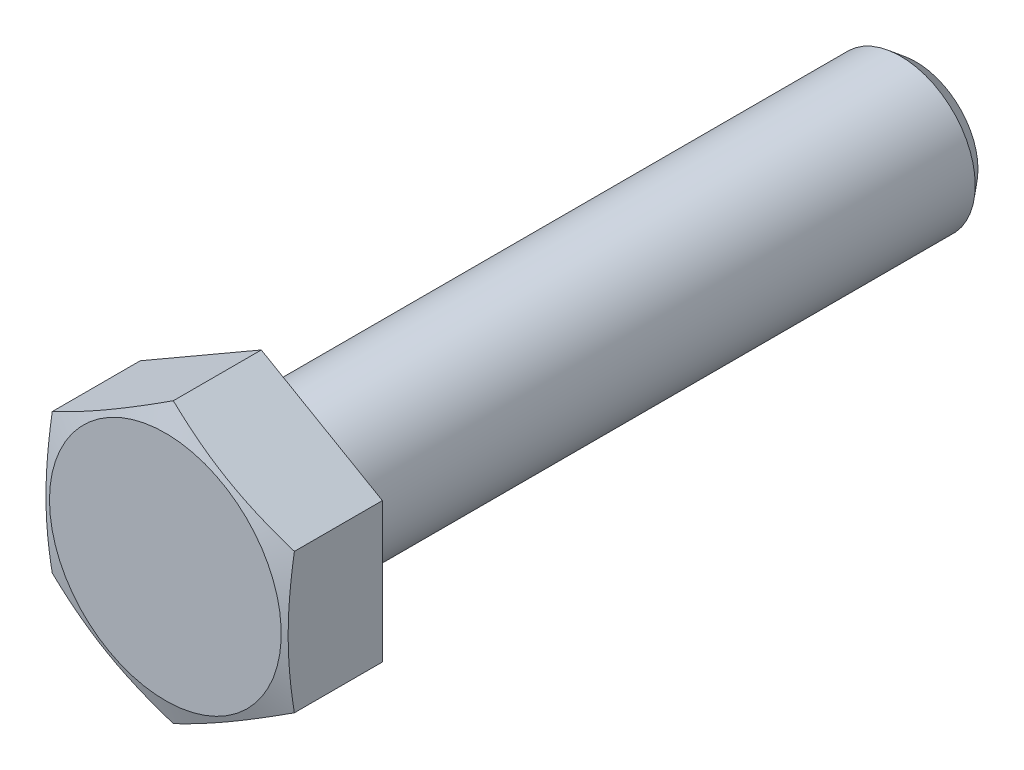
ISO-10303-21;
HEADER;
FILE_DESCRIPTION(('STEP AP214'),'2;1');
FILE_NAME('part.step','',(''),(''),'','','');
FILE_SCHEMA(('AUTOMOTIVE_DESIGN { 1 0 10303 214 1 1 1 1 }'));
ENDSEC;
DATA;
#1=APPLICATION_CONTEXT('core data for automotive mechanical design processes');
#2=APPLICATION_PROTOCOL_DEFINITION('international standard','automotive_design',2000,#1);
#3=PRODUCT_CONTEXT('',#1,'mechanical');
#4=PRODUCT('Part','Part','',(#3));
#5=PRODUCT_RELATED_PRODUCT_CATEGORY('part','',(#4));
#6=PRODUCT_DEFINITION_FORMATION('','',#4);
#7=PRODUCT_DEFINITION_CONTEXT('part definition',#1,'design');
#8=PRODUCT_DEFINITION('design','',#6,#7);
#9=PRODUCT_DEFINITION_SHAPE('','',#8);
#10=(LENGTH_UNIT() NAMED_UNIT(*) SI_UNIT(.MILLI.,.METRE.));
#11=(NAMED_UNIT(*) PLANE_ANGLE_UNIT() SI_UNIT($,.RADIAN.));
#12=(NAMED_UNIT(*) SI_UNIT($,.STERADIAN.) SOLID_ANGLE_UNIT());
#13=UNCERTAINTY_MEASURE_WITH_UNIT(LENGTH_MEASURE(1.E-05),#10,'distance_accuracy_value','');
#14=(GEOMETRIC_REPRESENTATION_CONTEXT(3) GLOBAL_UNCERTAINTY_ASSIGNED_CONTEXT((#13)) GLOBAL_UNIT_ASSIGNED_CONTEXT((#10,
#11,#12)) REPRESENTATION_CONTEXT('',''));
#15=CARTESIAN_POINT('',(0.,0.,0.));
#16=DIRECTION('',(0.,0.,1.));
#17=DIRECTION('',(1.,0.,0.));
#18=AXIS2_PLACEMENT_3D('',#15,#16,#17);
#19=CARTESIAN_POINT('',(0.,0.,0.15));
#20=DIRECTION('',(0.,0.,1.));
#21=DIRECTION('',(1.,0.,0.));
#22=AXIS2_PLACEMENT_3D('',#19,#20,#21);
#23=TOROIDAL_SURFACE('',#22,5.65,0.15);
#24=CARTESIAN_POINT('',(0.,0.,0.15));
#25=DIRECTION('',(0.,0.,1.));
#26=DIRECTION('',(1.,0.,0.));
#27=AXIS2_PLACEMENT_3D('',#24,#25,#26);
#28=CIRCLE('',#27,5.8);
#29=CARTESIAN_POINT('',(5.8,0.,0.15));
#30=VERTEX_POINT('',#29);
#31=EDGE_CURVE('E11',#30,#30,#28,.T.);
#32=ORIENTED_EDGE('',*,*,#31,.F.);
#33=EDGE_LOOP('',(#32));
#34=FACE_BOUND('',#33,.T.);
#35=CARTESIAN_POINT('',(0.,0.,0.));
#36=DIRECTION('',(0.,0.,1.));
#37=DIRECTION('',(1.,0.,0.));
#38=AXIS2_PLACEMENT_3D('',#35,#36,#37);
#39=CIRCLE('',#38,5.65);
#40=CARTESIAN_POINT('',(5.65,0.,0.));
#41=VERTEX_POINT('',#40);
#42=EDGE_CURVE('E39',#41,#41,#39,.T.);
#43=ORIENTED_EDGE('',*,*,#42,.T.);
#44=EDGE_LOOP('',(#43));
#45=FACE_BOUND('',#44,.T.);
#46=ADVANCED_FACE('F32',(#34,#45),#23,.T.);
#47=CARTESIAN_POINT('',(0.,5.65,0.));
#48=DIRECTION('',(0.,0.,-1.));
#49=DIRECTION('',(-1.,0.,0.));
#50=AXIS2_PLACEMENT_3D('',#47,#48,#49);
#51=PLANE('',#50);
#52=CARTESIAN_POINT('',(0.,0.,0.));
#53=DIRECTION('',(0.,0.,1.));
#54=DIRECTION('',(1.,0.,0.));
#55=AXIS2_PLACEMENT_3D('',#52,#53,#54);
#56=CIRCLE('',#55,4.4);
#57=CARTESIAN_POINT('',(4.4,0.,0.));
#58=VERTEX_POINT('',#57);
#59=EDGE_CURVE('E124',#58,#58,#56,.T.);
#60=ORIENTED_EDGE('',*,*,#59,.T.);
#61=EDGE_LOOP('',(#60));
#62=FACE_BOUND('',#61,.T.);
#63=ORIENTED_EDGE('',*,*,#42,.F.);
#64=EDGE_LOOP('',(#63));
#65=FACE_BOUND('',#64,.T.);
#66=ADVANCED_FACE('F130',(#62,#65),#51,.T.);
#67=CARTESIAN_POINT('',(0.,0.,-0.4));
#68=DIRECTION('',(0.,0.,1.));
#69=DIRECTION('',(1.,0.,0.));
#70=AXIS2_PLACEMENT_3D('',#67,#68,#69);
#71=TOROIDAL_SURFACE('',#70,4.4,0.4);
#72=CARTESIAN_POINT('',(0.,0.,-0.4));
#73=DIRECTION('',(0.,0.,1.));
#74=DIRECTION('',(1.,0.,0.));
#75=AXIS2_PLACEMENT_3D('',#72,#73,#74);
#76=CIRCLE('',#75,4.);
#77=CARTESIAN_POINT('',(4.,0.,-0.4));
#78=VERTEX_POINT('',#77);
#79=EDGE_CURVE('E121',#78,#78,#76,.T.);
#80=ORIENTED_EDGE('',*,*,#79,.T.);
#81=EDGE_LOOP('',(#80));
#82=FACE_BOUND('',#81,.T.);
#83=ORIENTED_EDGE('',*,*,#59,.F.);
#84=EDGE_LOOP('',(#83));
#85=FACE_BOUND('',#84,.T.);
#86=ADVANCED_FACE('F132',(#82,#85),#71,.F.);
#87=CARTESIAN_POINT('',(-6.5,-3.752775,0.15));
#88=DIRECTION('',(0.,0.,-1.));
#89=DIRECTION('',(-1.,0.,0.));
#90=AXIS2_PLACEMENT_3D('',#87,#88,#89);
#91=PLANE('',#90);
#92=DIRECTION('',(0.,-1.,0.));
#93=VECTOR('',#92,1.);
#94=CARTESIAN_POINT('',(-6.5,3.752775,0.15));
#95=LINE('',#94,#93);
#96=CARTESIAN_POINT('',(-6.5,3.752775,0.15));
#97=VERTEX_POINT('',#96);
#98=CARTESIAN_POINT('',(-6.5,-3.752775,0.15));
#99=VERTEX_POINT('',#98);
#100=EDGE_CURVE('E98',#97,#99,#95,.T.);
#101=ORIENTED_EDGE('',*,*,#100,.F.);
#102=DIRECTION('',(0.866025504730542,0.499999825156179,0.));
#103=VECTOR('',#102,1.);
#104=CARTESIAN_POINT('',(-6.5,3.752775,0.15));
#105=LINE('',#104,#103);
#106=CARTESIAN_POINT('',(0.,7.50555,0.15));
#107=VERTEX_POINT('',#106);
#108=EDGE_CURVE('E103',#97,#107,#105,.T.);
#109=ORIENTED_EDGE('',*,*,#108,.T.);
#110=DIRECTION('',(0.866025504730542,-0.499999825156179,0.));
#111=VECTOR('',#110,1.);
#112=CARTESIAN_POINT('',(0.,7.50555,0.15));
#113=LINE('',#112,#111);
#114=CARTESIAN_POINT('',(6.5,3.752775,0.15));
#115=VERTEX_POINT('',#114);
#116=EDGE_CURVE('E109',#107,#115,#113,.T.);
#117=ORIENTED_EDGE('',*,*,#116,.T.);
#118=DIRECTION('',(0.,-1.,0.));
#119=VECTOR('',#118,1.);
#120=CARTESIAN_POINT('',(6.5,3.752775,0.15));
#121=LINE('',#120,#119);
#122=CARTESIAN_POINT('',(6.5,-3.752775,0.15));
#123=VERTEX_POINT('',#122);
#124=EDGE_CURVE('E245',#115,#123,#121,.T.);
#125=ORIENTED_EDGE('',*,*,#124,.T.);
#126=DIRECTION('',(-0.866025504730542,-0.499999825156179,0.));
#127=VECTOR('',#126,1.);
#128=CARTESIAN_POINT('',(6.5,-3.752775,0.15));
#129=LINE('',#128,#127);
#130=CARTESIAN_POINT('',(0.,-7.50555,0.15));
#131=VERTEX_POINT('',#130);
#132=EDGE_CURVE('E231',#123,#131,#129,.T.);
#133=ORIENTED_EDGE('',*,*,#132,.T.);
#134=DIRECTION('',(-0.866025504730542,0.499999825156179,0.));
#135=VECTOR('',#134,1.);
#136=CARTESIAN_POINT('',(0.,-7.50555,0.15));
#137=LINE('',#136,#135);
#138=EDGE_CURVE('E229',#131,#99,#137,.T.);
#139=ORIENTED_EDGE('',*,*,#138,.T.);
#140=EDGE_LOOP('',(#101,#109,#117,#125,#133,#139));
#141=FACE_BOUND('',#140,.T.);
#142=ORIENTED_EDGE('',*,*,#31,.T.);
#143=EDGE_LOOP('',(#142));
#144=FACE_BOUND('',#143,.T.);
#145=ADVANCED_FACE('F138',(#141,#144),#91,.T.);
#146=CARTESIAN_POINT('',(-6.5,3.752775,0.15));
#147=DIRECTION('',(-1.,0.,0.));
#148=DIRECTION('',(0.,0.,1.));
#149=AXIS2_PLACEMENT_3D('',#146,#147,#148);
#150=PLANE('',#149);
#151=CARTESIAN_POINT('',(-6.5,-9.92768465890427,3.42219076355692));
#152=CARTESIAN_POINT('',(-6.5,-9.63320200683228,3.50410507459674));
#153=CARTESIAN_POINT('',(-6.5,-9.33844353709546,3.58504584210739));
#154=CARTESIAN_POINT('',(-6.5,-8.74823643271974,3.74444577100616));
#155=CARTESIAN_POINT('',(-6.5,-8.45278775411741,3.82290476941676));
#156=CARTESIAN_POINT('',(-6.5,-7.86064924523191,3.97691306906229));
#157=CARTESIAN_POINT('',(-6.5,-7.56395820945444,4.05245775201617));
#158=CARTESIAN_POINT('',(-6.5,-6.96964246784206,4.19977756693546));
#159=CARTESIAN_POINT('',(-6.5,-6.67201777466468,4.27155274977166));
#160=CARTESIAN_POINT('',(-6.5,-6.07920080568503,4.40958972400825));
#161=CARTESIAN_POINT('',(-6.5,-5.78402145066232,4.47590673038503));
#162=CARTESIAN_POINT('',(-6.5,-5.19244039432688,4.60283348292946));
#163=CARTESIAN_POINT('',(-6.5,-4.89603873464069,4.66344342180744));
#164=CARTESIAN_POINT('',(-6.5,-4.30192301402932,4.77756540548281));
#165=CARTESIAN_POINT('',(-6.5,-4.00420923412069,4.83107890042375));
#166=CARTESIAN_POINT('',(-6.5,-3.4073313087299,4.92939310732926));
#167=CARTESIAN_POINT('',(-6.5,-3.10816717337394,4.9741938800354));
#168=CARTESIAN_POINT('',(-6.5,-2.51584786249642,5.05231938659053));
#169=CARTESIAN_POINT('',(-6.5,-2.22272695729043,5.08590043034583));
#170=CARTESIAN_POINT('',(-6.5,-1.6353790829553,5.14147194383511));
#171=CARTESIAN_POINT('',(-6.5,-1.34115215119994,5.16346280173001));
#172=CARTESIAN_POINT('',(-6.5,-0.752211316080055,5.19459534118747));
#173=CARTESIAN_POINT('',(-6.5,-0.457497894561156,5.20374596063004));
#174=CARTESIAN_POINT('',(-6.5,0.132041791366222,5.20865235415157));
#175=CARTESIAN_POINT('',(-6.5,0.426868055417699,5.20440817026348));
#176=CARTESIAN_POINT('',(-6.5,1.01755930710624,5.18273935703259));
#177=CARTESIAN_POINT('',(-6.5,1.31342173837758,5.16524639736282));
#178=CARTESIAN_POINT('',(-6.5,1.90416213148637,5.11804868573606));
#179=CARTESIAN_POINT('',(-6.5,2.19904006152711,5.08834354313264));
#180=CARTESIAN_POINT('',(-6.5,2.78778899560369,5.01822295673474));
#181=CARTESIAN_POINT('',(-6.5,3.08165875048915,4.97779718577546));
#182=CARTESIAN_POINT('',(-6.5,3.66800309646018,4.88794282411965));
#183=CARTESIAN_POINT('',(-6.5,3.96047768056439,4.83851418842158));
#184=CARTESIAN_POINT('',(-6.5,4.53383951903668,4.734123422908));
#185=CARTESIAN_POINT('',(-6.5,4.81477360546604,4.67941596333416));
#186=CARTESIAN_POINT('',(-6.5,5.37549299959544,4.56437238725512));
#187=CARTESIAN_POINT('',(-6.5,5.65527825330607,4.50403600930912));
#188=CARTESIAN_POINT('',(-6.5,6.21386077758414,4.3787797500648));
#189=CARTESIAN_POINT('',(-6.5,6.49265788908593,4.31385916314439));
#190=CARTESIAN_POINT('',(-6.5,7.0493618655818,4.18029589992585));
#191=CARTESIAN_POINT('',(-6.5,7.3272687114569,4.11165314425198));
#192=CARTESIAN_POINT('',(-6.5,7.88244293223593,3.97129958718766));
#193=CARTESIAN_POINT('',(-6.5,8.159709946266,3.89958736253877));
#194=CARTESIAN_POINT('',(-6.5,8.71358713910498,3.75366585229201));
#195=CARTESIAN_POINT('',(-6.5,8.99019731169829,3.67945654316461));
#196=CARTESIAN_POINT('',(-6.5,9.81912857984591,3.45377511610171));
#197=CARTESIAN_POINT('',(-6.5,10.3706135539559,3.29923331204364));
#198=CARTESIAN_POINT('',(-6.5,11.4645427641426,2.98659237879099));
#199=CARTESIAN_POINT('',(-6.5,12.0070088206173,2.82856906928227));
#200=CARTESIAN_POINT('',(-6.5,13.090775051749,2.5085206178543));
#201=CARTESIAN_POINT('',(-6.5,13.6320751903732,2.34649535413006));
#202=CARTESIAN_POINT('',(-6.5,14.7126438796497,2.01984553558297));
#203=CARTESIAN_POINT('',(-6.5,15.2519143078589,1.85522717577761));
#204=CARTESIAN_POINT('',(-6.5,16.3297306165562,1.52373570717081));
#205=CARTESIAN_POINT('',(-6.5,16.8682765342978,1.3568627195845));
#206=CARTESIAN_POINT('',(-6.5,17.4065709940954,1.18919184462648));
#207=B_SPLINE_CURVE_WITH_KNOTS('',3,(#151,#152,#153,#154,#155,#156,#157,#158,#159,#160,#161,
#162,#163,#164,#165,#166,#167,#168,#169,#170,#171,#172,#173,#174,#175,#176,#177,#178,#179,#180,
#181,#182,#183,#184,#185,#186,#187,#188,#189,#190,#191,#192,#193,#194,#195,#196,#197,#198,#199,
#200,#201,#202,#203,#204,#205,#206),.UNSPECIFIED.,.F.,.F.,(4,2,2,2,2,2,2,2,2,2,2,2,2,2,2,2,2,2,
2,2,2,2,2,2,2,2,2,4),(0.,0.916995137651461,1.83405036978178,2.75250368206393,3.67094459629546,
4.57851158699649,5.48604792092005,6.39339851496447,7.30074278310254,8.18565759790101,
9.07054277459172,9.95481169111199,10.8390778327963,11.7279358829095,12.616822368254,
13.5065682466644,14.3963185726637,15.2548833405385,16.1134880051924,16.9722251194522,
17.830980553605,18.6901385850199,19.5493047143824,21.2674414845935,22.9624656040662,
24.6575413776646,26.3490461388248,28.0404603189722),.UNSPECIFIED.);
#208=CARTESIAN_POINT('',(-6.5,3.752775,4.87245657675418));
#209=VERTEX_POINT('',#208);
#210=CARTESIAN_POINT('',(-6.5,-3.752775,4.87245657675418));
#211=VERTEX_POINT('',#210);
#212=EDGE_CURVE('E87',#209,#211,#207,.F.);
#213=ORIENTED_EDGE('',*,*,#212,.F.);
#214=DIRECTION('',(0.,0.,1.));
#215=VECTOR('',#214,1.);
#216=CARTESIAN_POINT('',(-6.5,3.752775,0.15));
#217=LINE('',#216,#215);
#218=EDGE_CURVE('E96',#97,#209,#217,.T.);
#219=ORIENTED_EDGE('',*,*,#218,.F.);
#220=ORIENTED_EDGE('',*,*,#100,.T.);
#221=DIRECTION('',(0.,0.,1.));
#222=VECTOR('',#221,1.);
#223=CARTESIAN_POINT('',(-6.5,-3.752775,0.15));
#224=LINE('',#223,#222);
#225=EDGE_CURVE('E54',#99,#211,#224,.T.);
#226=ORIENTED_EDGE('',*,*,#225,.T.);
#227=EDGE_LOOP('',(#213,#219,#220,#226));
#228=FACE_BOUND('',#227,.T.);
#229=ADVANCED_FACE('F94',(#228),#150,.T.);
#230=CARTESIAN_POINT('',(0.,-7.50555,0.15));
#231=DIRECTION('',(0.499999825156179,0.866025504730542,0.));
#232=DIRECTION('',(0.866025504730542,-0.499999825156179,0.));
#233=AXIS2_PLACEMENT_3D('',#230,#231,#232);
#234=PLANE('',#233);
#235=DIRECTION('',(0.,0.,1.));
#236=VECTOR('',#235,1.);
#237=CARTESIAN_POINT('',(0.,-7.50555,0.15));
#238=LINE('',#237,#236);
#239=CARTESIAN_POINT('',(0.,-7.50555,4.87245744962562));
#240=VERTEX_POINT('',#239);
#241=EDGE_CURVE('E236',#131,#240,#238,.T.);
#242=ORIENTED_EDGE('',*,*,#241,.T.);
#243=CARTESIAN_POINT('',(2.00000000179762E-07,-7.50555011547,4.87245741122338));
#244=CARTESIAN_POINT('',(-0.269447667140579,-7.34998438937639,4.92421240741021));
#245=CARTESIAN_POINT('',(-0.539641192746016,-7.19398815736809,4.97125826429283));
#246=CARTESIAN_POINT('',(-1.08149605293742,-6.88114825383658,5.05398662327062));
#247=CARTESIAN_POINT('',(-1.35315821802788,-6.7243041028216,5.0896618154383));
#248=CARTESIAN_POINT('',(-1.89542621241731,-6.41122567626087,5.14740289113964));
#249=CARTESIAN_POINT('',(-2.16602338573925,-6.25499639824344,5.16957424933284));
#250=CARTESIAN_POINT('',(-2.7077471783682,-5.94223216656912,5.19930920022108));
#251=CARTESIAN_POINT('',(-2.97887360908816,-5.78569732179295,5.20687728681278));
#252=CARTESIAN_POINT('',(-3.52112646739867,-5.47262763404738,5.2068772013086));
#253=CARTESIAN_POINT('',(-3.79225289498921,-5.31609279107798,5.19930902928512));
#254=CARTESIAN_POINT('',(-4.33397667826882,-5.00332856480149,5.16957391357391));
#255=CARTESIAN_POINT('',(-4.60457384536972,-4.84709929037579,5.14740247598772));
#256=CARTESIAN_POINT('',(-5.14684182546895,-4.5340208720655,5.08966125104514));
#257=CARTESIAN_POINT('',(-5.41850398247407,-4.37717672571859,5.05398598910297));
#258=CARTESIAN_POINT('',(-5.96035882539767,-4.06433683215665,4.97125750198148));
#259=CARTESIAN_POINT('',(-6.23055234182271,-3.90834060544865,4.92421158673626));
#260=CARTESIAN_POINT('',(-6.5000002,-3.75277488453,4.87245653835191));
#261=B_SPLINE_CURVE_WITH_KNOTS('',3,(#243,#244,#245,#246,#247,#248,#249,#250,#251,#252,#253,
#254,#255,#256,#257,#258,#259,#260),.UNSPECIFIED.,.F.,.F.,(4,2,2,2,2,2,2,2,4),(0.,
0.946299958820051,1.89320704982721,2.83261995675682,3.7717437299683,4.71086749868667,
5.65028040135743,6.59718748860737,7.54348744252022),.UNSPECIFIED.);
#262=EDGE_CURVE('E99',#240,#211,#261,.T.);
#263=ORIENTED_EDGE('',*,*,#262,.T.);
#264=ORIENTED_EDGE('',*,*,#225,.F.);
#265=ORIENTED_EDGE('',*,*,#138,.F.);
#266=EDGE_LOOP('',(#242,#263,#264,#265));
#267=FACE_BOUND('',#266,.T.);
#268=ADVANCED_FACE('F159',(#267),#234,.F.);
#269=CARTESIAN_POINT('',(6.5,-3.752775,0.15));
#270=DIRECTION('',(-0.499999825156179,0.866025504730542,0.));
#271=DIRECTION('',(0.866025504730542,0.499999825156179,0.));
#272=AXIS2_PLACEMENT_3D('',#269,#270,#271);
#273=PLANE('',#272);
#274=DIRECTION('',(0.,0.,1.));
#275=VECTOR('',#274,1.);
#276=CARTESIAN_POINT('',(6.5,-3.752775,0.15));
#277=LINE('',#276,#275);
#278=CARTESIAN_POINT('',(6.5,-3.752775,4.87245657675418));
#279=VERTEX_POINT('',#278);
#280=EDGE_CURVE('E239',#123,#279,#277,.T.);
#281=ORIENTED_EDGE('',*,*,#280,.T.);
#282=CARTESIAN_POINT('',(6.5000002,-3.75277488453,4.87245653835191));
#283=CARTESIAN_POINT('',(6.23055234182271,-3.90834060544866,4.92421158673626));
#284=CARTESIAN_POINT('',(5.96035882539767,-4.06433683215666,4.97125750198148));
#285=CARTESIAN_POINT('',(5.41850398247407,-4.37717672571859,5.05398598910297));
#286=CARTESIAN_POINT('',(5.14684182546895,-4.5340208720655,5.08966125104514));
#287=CARTESIAN_POINT('',(4.60457384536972,-4.84709929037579,5.14740247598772));
#288=CARTESIAN_POINT('',(4.33397667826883,-5.00332856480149,5.16957391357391));
#289=CARTESIAN_POINT('',(3.79225289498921,-5.31609279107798,5.19930902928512));
#290=CARTESIAN_POINT('',(3.52112646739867,-5.47262763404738,5.20687720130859));
#291=CARTESIAN_POINT('',(2.97887360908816,-5.78569732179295,5.20687728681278));
#292=CARTESIAN_POINT('',(2.7077471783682,-5.94223216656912,5.19930920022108));
#293=CARTESIAN_POINT('',(2.16602338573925,-6.25499639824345,5.16957424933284));
#294=CARTESIAN_POINT('',(1.89542621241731,-6.41122567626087,5.14740289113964));
#295=CARTESIAN_POINT('',(1.35315821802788,-6.72430410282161,5.0896618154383));
#296=CARTESIAN_POINT('',(1.08149605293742,-6.88114825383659,5.05398662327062));
#297=CARTESIAN_POINT('',(0.539641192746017,-7.19398815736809,4.97125826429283));
#298=CARTESIAN_POINT('',(0.269447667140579,-7.34998438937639,4.92421240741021));
#299=CARTESIAN_POINT('',(-2.00000001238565E-07,-7.50555011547,4.87245741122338));
#300=B_SPLINE_CURVE_WITH_KNOTS('',3,(#282,#283,#284,#285,#286,#287,#288,#289,#290,#291,#292,
#293,#294,#295,#296,#297,#298,#299),.UNSPECIFIED.,.F.,.F.,(4,2,2,2,2,2,2,2,4),(0.,
0.94629995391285,1.89320704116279,2.83261994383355,3.77174371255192,4.7108674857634,
5.65028039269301,6.59718748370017,7.54348744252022),.UNSPECIFIED.);
#301=EDGE_CURVE('E201',#279,#240,#300,.T.);
#302=ORIENTED_EDGE('',*,*,#301,.T.);
#303=ORIENTED_EDGE('',*,*,#241,.F.);
#304=ORIENTED_EDGE('',*,*,#132,.F.);
#305=EDGE_LOOP('',(#281,#302,#303,#304));
#306=FACE_BOUND('',#305,.T.);
#307=ADVANCED_FACE('F207',(#306),#273,.F.);
#308=CARTESIAN_POINT('',(6.5,3.752775,0.15));
#309=DIRECTION('',(-1.,0.,0.));
#310=DIRECTION('',(0.,0.,1.));
#311=AXIS2_PLACEMENT_3D('',#308,#309,#310);
#312=PLANE('',#311);
#313=DIRECTION('',(0.,0.,1.));
#314=VECTOR('',#313,1.);
#315=CARTESIAN_POINT('',(6.5,3.752775,0.15));
#316=LINE('',#315,#314);
#317=CARTESIAN_POINT('',(6.5,3.752775,4.87245657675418));
#318=VERTEX_POINT('',#317);
#319=EDGE_CURVE('E107',#115,#318,#316,.T.);
#320=ORIENTED_EDGE('',*,*,#319,.T.);
#321=CARTESIAN_POINT('',(6.5,-9.92768465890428,3.42219076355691));
#322=CARTESIAN_POINT('',(6.5,-9.63320200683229,3.50410507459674));
#323=CARTESIAN_POINT('',(6.5,-9.33844353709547,3.58504584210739));
#324=CARTESIAN_POINT('',(6.5,-8.74823643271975,3.74444577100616));
#325=CARTESIAN_POINT('',(6.5,-8.45278775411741,3.82290476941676));
#326=CARTESIAN_POINT('',(6.5,-7.86064924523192,3.97691306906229));
#327=CARTESIAN_POINT('',(6.5,-7.56395820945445,4.05245775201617));
#328=CARTESIAN_POINT('',(6.5,-6.96964246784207,4.19977756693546));
#329=CARTESIAN_POINT('',(6.5,-6.67201777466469,4.27155274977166));
#330=CARTESIAN_POINT('',(6.5,-6.07920080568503,4.40958972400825));
#331=CARTESIAN_POINT('',(6.5,-5.78402145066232,4.47590673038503));
#332=CARTESIAN_POINT('',(6.5,-5.19244039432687,4.60283348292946));
#333=CARTESIAN_POINT('',(6.5,-4.89603873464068,4.66344342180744));
#334=CARTESIAN_POINT('',(6.5,-4.30192301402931,4.77756540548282));
#335=CARTESIAN_POINT('',(6.5,-4.00420923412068,4.83107890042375));
#336=CARTESIAN_POINT('',(6.5,-3.4073313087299,4.92939310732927));
#337=CARTESIAN_POINT('',(6.5,-3.10816717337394,4.97419388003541));
#338=CARTESIAN_POINT('',(6.5,-2.51584786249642,5.05231938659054));
#339=CARTESIAN_POINT('',(6.5,-2.22272695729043,5.08590043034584));
#340=CARTESIAN_POINT('',(6.5,-1.6353790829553,5.14147194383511));
#341=CARTESIAN_POINT('',(6.5,-1.34115215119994,5.16346280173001));
#342=CARTESIAN_POINT('',(6.5,-0.752211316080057,5.19459534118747));
#343=CARTESIAN_POINT('',(6.5,-0.457497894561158,5.20374596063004));
#344=CARTESIAN_POINT('',(6.5,0.132041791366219,5.20865235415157));
#345=CARTESIAN_POINT('',(6.5,0.426868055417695,5.20440817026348));
#346=CARTESIAN_POINT('',(6.5,1.01755930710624,5.18273935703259));
#347=CARTESIAN_POINT('',(6.5,1.31342173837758,5.16524639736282));
#348=CARTESIAN_POINT('',(6.5,1.90416213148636,5.11804868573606));
#349=CARTESIAN_POINT('',(6.5,2.19904006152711,5.08834354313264));
#350=CARTESIAN_POINT('',(6.5,2.78778899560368,5.01822295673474));
#351=CARTESIAN_POINT('',(6.5,3.08165875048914,4.97779718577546));
#352=CARTESIAN_POINT('',(6.5,3.66800309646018,4.88794282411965));
#353=CARTESIAN_POINT('',(6.5,3.96047768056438,4.83851418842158));
#354=CARTESIAN_POINT('',(6.5,4.53383951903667,4.734123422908));
#355=CARTESIAN_POINT('',(6.5,4.81477360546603,4.67941596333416));
#356=CARTESIAN_POINT('',(6.5,5.37549299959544,4.56437238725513));
#357=CARTESIAN_POINT('',(6.5,5.65527825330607,4.50403600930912));
#358=CARTESIAN_POINT('',(6.5,6.21386077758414,4.3787797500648));
#359=CARTESIAN_POINT('',(6.5,6.49265788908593,4.31385916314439));
#360=CARTESIAN_POINT('',(6.5,7.0493618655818,4.18029589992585));
#361=CARTESIAN_POINT('',(6.5,7.3272687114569,4.11165314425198));
#362=CARTESIAN_POINT('',(6.5,7.88244293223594,3.97129958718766));
#363=CARTESIAN_POINT('',(6.5,8.15970994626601,3.89958736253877));
#364=CARTESIAN_POINT('',(6.5,8.71358713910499,3.75366585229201));
#365=CARTESIAN_POINT('',(6.5,8.9901973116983,3.67945654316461));
#366=CARTESIAN_POINT('',(6.5,9.81912857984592,3.45377511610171));
#367=CARTESIAN_POINT('',(6.5,10.3706135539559,3.29923331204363));
#368=CARTESIAN_POINT('',(6.5,11.4645427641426,2.98659237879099));
#369=CARTESIAN_POINT('',(6.5,12.0070088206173,2.82856906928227));
#370=CARTESIAN_POINT('',(6.5,13.090775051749,2.5085206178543));
#371=CARTESIAN_POINT('',(6.5,13.6320751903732,2.34649535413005));
#372=CARTESIAN_POINT('',(6.5,14.7126438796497,2.01984553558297));
#373=CARTESIAN_POINT('',(6.5,15.2519143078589,1.85522717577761));
#374=CARTESIAN_POINT('',(6.5,16.3297306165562,1.52373570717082));
#375=CARTESIAN_POINT('',(6.5,16.8682765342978,1.3568627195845));
#376=CARTESIAN_POINT('',(6.5,17.4065709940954,1.18919184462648));
#377=B_SPLINE_CURVE_WITH_KNOTS('',3,(#321,#322,#323,#324,#325,#326,#327,#328,#329,#330,#331,
#332,#333,#334,#335,#336,#337,#338,#339,#340,#341,#342,#343,#344,#345,#346,#347,#348,#349,#350,
#351,#352,#353,#354,#355,#356,#357,#358,#359,#360,#361,#362,#363,#364,#365,#366,#367,#368,#369,
#370,#371,#372,#373,#374,#375,#376),.UNSPECIFIED.,.F.,.F.,(4,2,2,2,2,2,2,2,2,2,2,2,2,2,2,2,2,2,
2,2,2,2,2,2,2,2,2,4),(0.,0.916995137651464,1.83405036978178,2.75250368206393,3.67094459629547,
4.57851158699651,5.48604792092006,6.39339851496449,7.30074278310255,8.18565759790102,
9.07054277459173,9.954811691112,10.8390778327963,11.7279358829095,12.616822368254,
13.5065682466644,14.3963185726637,15.2548833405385,16.1134880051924,16.9722251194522,
17.830980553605,18.6901385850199,19.5493047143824,21.2674414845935,22.9624656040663,
24.6575413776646,26.3490461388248,28.0404603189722),.UNSPECIFIED.);
#378=EDGE_CURVE('E195',#318,#279,#377,.F.);
#379=ORIENTED_EDGE('',*,*,#378,.T.);
#380=ORIENTED_EDGE('',*,*,#280,.F.);
#381=ORIENTED_EDGE('',*,*,#124,.F.);
#382=EDGE_LOOP('',(#320,#379,#380,#381));
#383=FACE_BOUND('',#382,.T.);
#384=ADVANCED_FACE('F210',(#383),#312,.F.);
#385=CARTESIAN_POINT('',(0.,7.50555,0.15));
#386=DIRECTION('',(-0.499999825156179,-0.866025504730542,0.));
#387=DIRECTION('',(-0.866025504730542,0.499999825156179,0.));
#388=AXIS2_PLACEMENT_3D('',#385,#386,#387);
#389=PLANE('',#388);
#390=DIRECTION('',(0.,0.,1.));
#391=VECTOR('',#390,1.);
#392=CARTESIAN_POINT('',(0.,7.50555,0.15));
#393=LINE('',#392,#391);
#394=CARTESIAN_POINT('',(0.,7.50555,4.87245744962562));
#395=VERTEX_POINT('',#394);
#396=EDGE_CURVE('E105',#107,#395,#393,.T.);
#397=ORIENTED_EDGE('',*,*,#396,.T.);
#398=CARTESIAN_POINT('',(-1.99999999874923E-07,7.50555011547,4.87245741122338));
#399=CARTESIAN_POINT('',(0.269447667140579,7.34998438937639,4.92421240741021));
#400=CARTESIAN_POINT('',(0.539641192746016,7.19398815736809,4.97125826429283));
#401=CARTESIAN_POINT('',(1.08149605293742,6.88114825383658,5.05398662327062));
#402=CARTESIAN_POINT('',(1.35315821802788,6.7243041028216,5.0896618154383));
#403=CARTESIAN_POINT('',(1.89542621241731,6.41122567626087,5.14740289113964));
#404=CARTESIAN_POINT('',(2.16602338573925,6.25499639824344,5.16957424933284));
#405=CARTESIAN_POINT('',(2.7077471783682,5.94223216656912,5.19930920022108));
#406=CARTESIAN_POINT('',(2.97887360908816,5.78569732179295,5.20687728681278));
#407=CARTESIAN_POINT('',(3.52112646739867,5.47262763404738,5.2068772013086));
#408=CARTESIAN_POINT('',(3.79225289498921,5.31609279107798,5.19930902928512));
#409=CARTESIAN_POINT('',(4.33397667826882,5.00332856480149,5.16957391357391));
#410=CARTESIAN_POINT('',(4.60457384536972,4.84709929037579,5.14740247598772));
#411=CARTESIAN_POINT('',(5.14684182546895,4.5340208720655,5.08966125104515));
#412=CARTESIAN_POINT('',(5.41850398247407,4.37717672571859,5.05398598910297));
#413=CARTESIAN_POINT('',(5.96035882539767,4.06433683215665,4.97125750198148));
#414=CARTESIAN_POINT('',(6.23055234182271,3.90834060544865,4.92421158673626));
#415=CARTESIAN_POINT('',(6.5000002,3.75277488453,4.87245653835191));
#416=B_SPLINE_CURVE_WITH_KNOTS('',3,(#398,#399,#400,#401,#402,#403,#404,#405,#406,#407,#408,
#409,#410,#411,#412,#413,#414,#415),.UNSPECIFIED.,.F.,.F.,(4,2,2,2,2,2,2,2,4),(0.,
0.946299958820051,1.89320704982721,2.83261995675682,3.7717437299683,4.71086749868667,
5.65028040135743,6.59718748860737,7.54348744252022),.UNSPECIFIED.);
#417=EDGE_CURVE('E46',#395,#318,#416,.T.);
#418=ORIENTED_EDGE('',*,*,#417,.T.);
#419=ORIENTED_EDGE('',*,*,#319,.F.);
#420=ORIENTED_EDGE('',*,*,#116,.F.);
#421=EDGE_LOOP('',(#397,#418,#419,#420));
#422=FACE_BOUND('',#421,.T.);
#423=ADVANCED_FACE('F214',(#422),#389,.F.);
#424=CARTESIAN_POINT('',(-6.5,3.752775,0.15));
#425=DIRECTION('',(0.499999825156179,-0.866025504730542,0.));
#426=DIRECTION('',(-0.866025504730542,-0.499999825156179,0.));
#427=AXIS2_PLACEMENT_3D('',#424,#425,#426);
#428=PLANE('',#427);
#429=ORIENTED_EDGE('',*,*,#218,.T.);
#430=CARTESIAN_POINT('',(-6.5000002,3.75277488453,4.8724565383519));
#431=CARTESIAN_POINT('',(-6.23055234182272,3.90834060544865,4.92421158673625));
#432=CARTESIAN_POINT('',(-5.96035882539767,4.06433683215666,4.97125750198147));
#433=CARTESIAN_POINT('',(-5.41850398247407,4.37717672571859,5.05398598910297));
#434=CARTESIAN_POINT('',(-5.14684182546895,4.5340208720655,5.08966125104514));
#435=CARTESIAN_POINT('',(-4.60457384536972,4.84709929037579,5.14740247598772));
#436=CARTESIAN_POINT('',(-4.33397667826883,5.00332856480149,5.16957391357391));
#437=CARTESIAN_POINT('',(-3.79225289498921,5.31609279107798,5.19930902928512));
#438=CARTESIAN_POINT('',(-3.52112646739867,5.47262763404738,5.20687720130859));
#439=CARTESIAN_POINT('',(-2.97887360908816,5.78569732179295,5.20687728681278));
#440=CARTESIAN_POINT('',(-2.7077471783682,5.94223216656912,5.19930920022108));
#441=CARTESIAN_POINT('',(-2.16602338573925,6.25499639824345,5.16957424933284));
#442=CARTESIAN_POINT('',(-1.89542621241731,6.41122567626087,5.14740289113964));
#443=CARTESIAN_POINT('',(-1.35315821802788,6.72430410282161,5.0896618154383));
#444=CARTESIAN_POINT('',(-1.08149605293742,6.88114825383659,5.05398662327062));
#445=CARTESIAN_POINT('',(-0.539641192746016,7.19398815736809,4.97125826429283));
#446=CARTESIAN_POINT('',(-0.269447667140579,7.34998438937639,4.92421240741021));
#447=CARTESIAN_POINT('',(2.00000001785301E-07,7.50555011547,4.87245741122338));
#448=B_SPLINE_CURVE_WITH_KNOTS('',3,(#430,#431,#432,#433,#434,#435,#436,#437,#438,#439,#440,
#441,#442,#443,#444,#445,#446,#447),.UNSPECIFIED.,.F.,.F.,(4,2,2,2,2,2,2,2,4),(0.,
0.946299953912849,1.89320704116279,2.83261994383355,3.77174371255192,4.7108674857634,
5.65028039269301,6.59718748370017,7.54348744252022),.UNSPECIFIED.);
#449=EDGE_CURVE('E83',#209,#395,#448,.T.);
#450=ORIENTED_EDGE('',*,*,#449,.T.);
#451=ORIENTED_EDGE('',*,*,#396,.F.);
#452=ORIENTED_EDGE('',*,*,#108,.F.);
#453=EDGE_LOOP('',(#429,#450,#451,#452));
#454=FACE_BOUND('',#453,.T.);
#455=ADVANCED_FACE('F101',(#454),#428,.F.);
#456=CARTESIAN_POINT('',(0.,0.,4.82253454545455));
#457=DIRECTION('',(0.,0.,-1.));
#458=DIRECTION('',(-1.,0.,0.));
#459=AXIS2_PLACEMENT_3D('',#456,#457,#458);
#460=CONICAL_SURFACE('',#459,7.655661,1.24972999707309);
#461=ORIENTED_EDGE('',*,*,#212,.T.);
#462=ORIENTED_EDGE('',*,*,#262,.F.);
#463=ORIENTED_EDGE('',*,*,#301,.F.);
#464=ORIENTED_EDGE('',*,*,#378,.F.);
#465=ORIENTED_EDGE('',*,*,#417,.F.);
#466=ORIENTED_EDGE('',*,*,#449,.F.);
#467=EDGE_LOOP('',(#461,#462,#463,#464,#465,#466));
#468=FACE_BOUND('',#467,.T.);
#469=CARTESIAN_POINT('',(0.,0.,5.3));
#470=DIRECTION('',(0.,0.,-1.));
#471=DIRECTION('',(-1.,0.,0.));
#472=AXIS2_PLACEMENT_3D('',#469,#470,#471);
#473=CIRCLE('',#472,6.21999097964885);
#474=CARTESIAN_POINT('',(-6.21999097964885,0.,5.3));
#475=VERTEX_POINT('',#474);
#476=EDGE_CURVE('E91',#475,#475,#473,.F.);
#477=ORIENTED_EDGE('',*,*,#476,.F.);
#478=EDGE_LOOP('',(#477));
#479=FACE_BOUND('',#478,.T.);
#480=ADVANCED_FACE('F85',(#468,#479),#460,.T.);
#481=CARTESIAN_POINT('',(-6.5,-3.752775,5.3));
#482=DIRECTION('',(0.,0.,-1.));
#483=DIRECTION('',(-1.,0.,0.));
#484=AXIS2_PLACEMENT_3D('',#481,#482,#483);
#485=PLANE('',#484);
#486=ORIENTED_EDGE('',*,*,#476,.T.);
#487=EDGE_LOOP('',(#486));
#488=FACE_BOUND('',#487,.T.);
#489=ADVANCED_FACE('F154',(#488),#485,.F.);
#490=CARTESIAN_POINT('',(0.,3.3234375,-35.));
#491=DIRECTION('',(0.,0.,-1.));
#492=DIRECTION('',(-1.,0.,0.));
#493=AXIS2_PLACEMENT_3D('',#490,#491,#492);
#494=PLANE('',#493);
#495=CARTESIAN_POINT('',(0.,0.,-35.));
#496=DIRECTION('',(0.,0.,1.));
#497=DIRECTION('',(1.,0.,0.));
#498=AXIS2_PLACEMENT_3D('',#495,#496,#497);
#499=CIRCLE('',#498,3.3234375);
#500=CARTESIAN_POINT('',(3.3234375,0.,-35.));
#501=VERTEX_POINT('',#500);
#502=EDGE_CURVE('E115',#501,#501,#499,.T.);
#503=ORIENTED_EDGE('',*,*,#502,.F.);
#504=EDGE_LOOP('',(#503));
#505=FACE_BOUND('',#504,.T.);
#506=ADVANCED_FACE('F150',(#505),#494,.T.);
#507=CARTESIAN_POINT('',(0.,0.,-34.1734375));
#508=DIRECTION('',(0.,0.,1.));
#509=DIRECTION('',(1.,0.,0.));
#510=AXIS2_PLACEMENT_3D('',#507,#508,#509);
#511=CONICAL_SURFACE('',#510,4.,0.68593535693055);
#512=ORIENTED_EDGE('',*,*,#502,.T.);
#513=EDGE_LOOP('',(#512));
#514=FACE_BOUND('',#513,.T.);
#515=CARTESIAN_POINT('',(0.,0.,-34.1734375));
#516=DIRECTION('',(0.,0.,1.));
#517=DIRECTION('',(1.,0.,0.));
#518=AXIS2_PLACEMENT_3D('',#515,#516,#517);
#519=CIRCLE('',#518,4.);
#520=CARTESIAN_POINT('',(4.,0.,-34.1734375));
#521=VERTEX_POINT('',#520);
#522=EDGE_CURVE('E118',#521,#521,#519,.T.);
#523=ORIENTED_EDGE('',*,*,#522,.F.);
#524=EDGE_LOOP('',(#523));
#525=FACE_BOUND('',#524,.T.);
#526=ADVANCED_FACE('F146',(#514,#525),#511,.T.);
#527=CARTESIAN_POINT('',(0.,0.,0.15));
#528=DIRECTION('',(0.,0.,1.));
#529=DIRECTION('',(1.,0.,0.));
#530=AXIS2_PLACEMENT_3D('',#527,#528,#529);
#531=CYLINDRICAL_SURFACE('',#530,4.);
#532=ORIENTED_EDGE('',*,*,#522,.T.);
#533=EDGE_LOOP('',(#532));
#534=FACE_BOUND('',#533,.T.);
#535=ORIENTED_EDGE('',*,*,#79,.F.);
#536=EDGE_LOOP('',(#535));
#537=FACE_BOUND('',#536,.T.);
#538=ADVANCED_FACE('F143',(#534,#537),#531,.T.);
#539=CLOSED_SHELL('',(#46,#66,#86,#145,#229,#268,#307,#384,#423,#455,#480,#489,#506,#526,#538));
#540=MANIFOLD_SOLID_BREP('B2',#539);
#541=ADVANCED_BREP_SHAPE_REPRESENTATION('',(#18,#540),#14);
#542=SHAPE_DEFINITION_REPRESENTATION(#9,#541);
ENDSEC;
END-ISO-10303-21;
